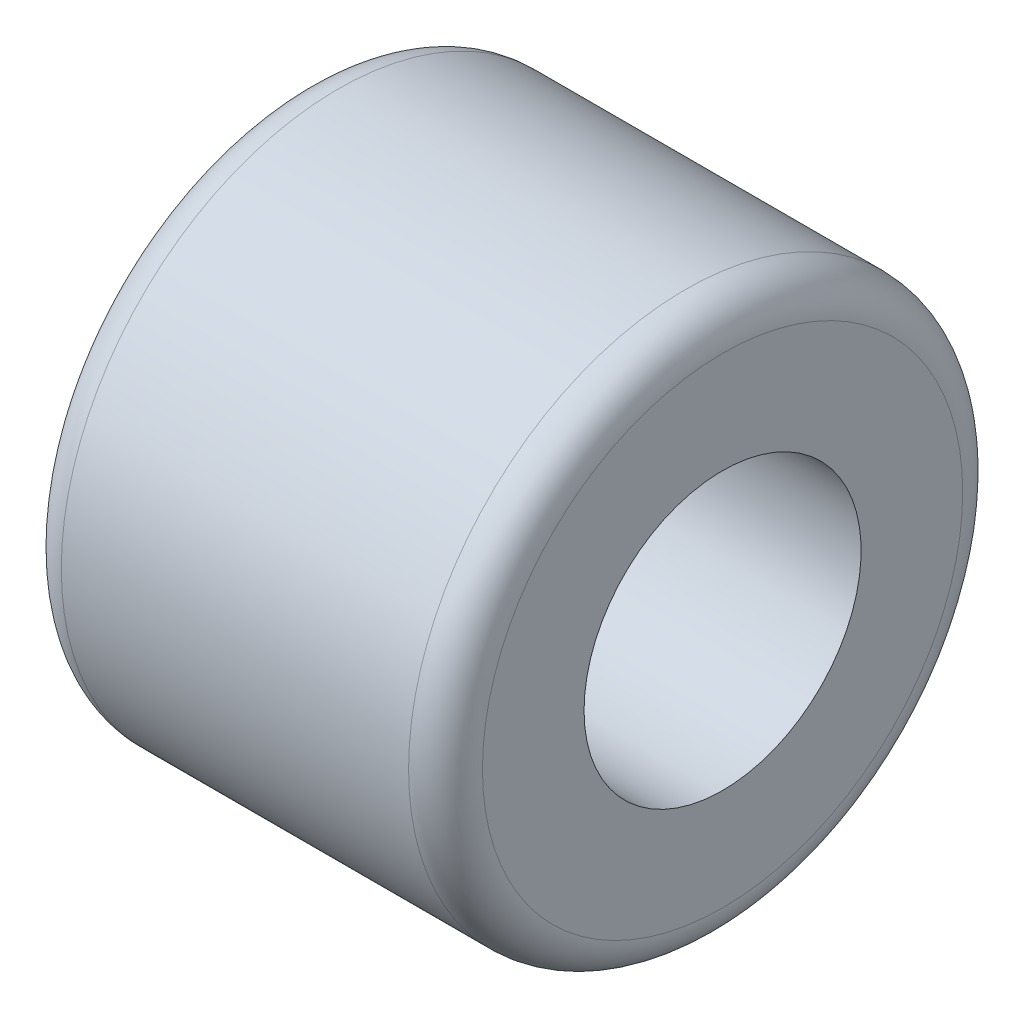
ISO-10303-21;
HEADER;
FILE_DESCRIPTION(('STEP AP214'),'2;1');
FILE_NAME('part.step','',(''),(''),'','','');
FILE_SCHEMA(('AUTOMOTIVE_DESIGN { 1 0 10303 214 1 1 1 1 }'));
ENDSEC;
DATA;
#1=APPLICATION_CONTEXT('core data for automotive mechanical design processes');
#2=APPLICATION_PROTOCOL_DEFINITION('international standard','automotive_design',2000,#1);
#3=PRODUCT_CONTEXT('',#1,'mechanical');
#4=PRODUCT('Part','Part','',(#3));
#5=PRODUCT_RELATED_PRODUCT_CATEGORY('part','',(#4));
#6=PRODUCT_DEFINITION_FORMATION('','',#4);
#7=PRODUCT_DEFINITION_CONTEXT('part definition',#1,'design');
#8=PRODUCT_DEFINITION('design','',#6,#7);
#9=PRODUCT_DEFINITION_SHAPE('','',#8);
#10=(LENGTH_UNIT() NAMED_UNIT(*) SI_UNIT(.MILLI.,.METRE.));
#11=(NAMED_UNIT(*) PLANE_ANGLE_UNIT() SI_UNIT($,.RADIAN.));
#12=(NAMED_UNIT(*) SI_UNIT($,.STERADIAN.) SOLID_ANGLE_UNIT());
#13=UNCERTAINTY_MEASURE_WITH_UNIT(LENGTH_MEASURE(1.E-05),#10,'distance_accuracy_value','');
#14=(GEOMETRIC_REPRESENTATION_CONTEXT(3) GLOBAL_UNCERTAINTY_ASSIGNED_CONTEXT((#13)) GLOBAL_UNIT_ASSIGNED_CONTEXT((#10,
#11,#12)) REPRESENTATION_CONTEXT('',''));
#15=CARTESIAN_POINT('',(0.,0.,0.));
#16=DIRECTION('',(0.,0.,1.));
#17=DIRECTION('',(1.,0.,0.));
#18=AXIS2_PLACEMENT_3D('',#15,#16,#17);
#19=CARTESIAN_POINT('',(-19.,21.6666666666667,0.));
#20=DIRECTION('',(1.,0.,0.));
#21=DIRECTION('',(0.,0.,-1.));
#22=AXIS2_PLACEMENT_3D('',#19,#20,#21);
#23=PLANE('',#22);
#24=CARTESIAN_POINT('',(-19.,0.,0.));
#25=DIRECTION('',(-1.,0.,0.));
#26=DIRECTION('',(0.,0.,1.));
#27=AXIS2_PLACEMENT_3D('',#24,#25,#26);
#28=CIRCLE('',#27,12.5);
#29=CARTESIAN_POINT('',(-19.,0.,12.5));
#30=VERTEX_POINT('',#29);
#31=EDGE_CURVE('E10',#30,#30,#28,.T.);
#32=ORIENTED_EDGE('',*,*,#31,.F.);
#33=EDGE_LOOP('',(#32));
#34=FACE_BOUND('',#33,.T.);
#35=CARTESIAN_POINT('',(-19.,0.,0.));
#36=DIRECTION('',(-1.,0.,0.));
#37=DIRECTION('',(0.,0.,1.));
#38=AXIS2_PLACEMENT_3D('',#35,#36,#37);
#39=CIRCLE('',#38,21.6666666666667);
#40=CARTESIAN_POINT('',(-19.,0.,21.6666666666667));
#41=VERTEX_POINT('',#40);
#42=EDGE_CURVE('E54',#41,#41,#39,.T.);
#43=ORIENTED_EDGE('',*,*,#42,.T.);
#44=EDGE_LOOP('',(#43));
#45=FACE_BOUND('',#44,.T.);
#46=ADVANCED_FACE('F32',(#34,#45),#23,.F.);
#47=CARTESIAN_POINT('',(50.,0.,0.));
#48=DIRECTION('',(-1.,0.,0.));
#49=DIRECTION('',(0.,0.,1.));
#50=AXIS2_PLACEMENT_3D('',#47,#48,#49);
#51=CYLINDRICAL_SURFACE('',#50,12.5);
#52=CARTESIAN_POINT('',(19.,0.,0.));
#53=DIRECTION('',(-1.,0.,0.));
#54=DIRECTION('',(0.,0.,1.));
#55=AXIS2_PLACEMENT_3D('',#52,#53,#54);
#56=CIRCLE('',#55,12.5);
#57=CARTESIAN_POINT('',(19.,0.,12.5));
#58=VERTEX_POINT('',#57);
#59=EDGE_CURVE('E38',#58,#58,#56,.T.);
#60=ORIENTED_EDGE('',*,*,#59,.F.);
#61=EDGE_LOOP('',(#60));
#62=FACE_BOUND('',#61,.T.);
#63=ORIENTED_EDGE('',*,*,#31,.T.);
#64=EDGE_LOOP('',(#63));
#65=FACE_BOUND('',#64,.T.);
#66=ADVANCED_FACE('F79',(#62,#65),#51,.F.);
#67=CARTESIAN_POINT('',(19.,12.5,0.));
#68=DIRECTION('',(-1.,0.,0.));
#69=DIRECTION('',(0.,0.,1.));
#70=AXIS2_PLACEMENT_3D('',#67,#68,#69);
#71=PLANE('',#70);
#72=CARTESIAN_POINT('',(19.,0.,0.));
#73=DIRECTION('',(-1.,0.,0.));
#74=DIRECTION('',(0.,0.,1.));
#75=AXIS2_PLACEMENT_3D('',#72,#73,#74);
#76=CIRCLE('',#75,21.6666666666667);
#77=CARTESIAN_POINT('',(19.,0.,21.6666666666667));
#78=VERTEX_POINT('',#77);
#79=EDGE_CURVE('E42',#78,#78,#76,.T.);
#80=ORIENTED_EDGE('',*,*,#79,.F.);
#81=EDGE_LOOP('',(#80));
#82=FACE_BOUND('',#81,.T.);
#83=ORIENTED_EDGE('',*,*,#59,.T.);
#84=EDGE_LOOP('',(#83));
#85=FACE_BOUND('',#84,.T.);
#86=ADVANCED_FACE('F74',(#82,#85),#71,.F.);
#87=CARTESIAN_POINT('',(15.6666666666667,0.,0.));
#88=DIRECTION('',(-1.,0.,0.));
#89=DIRECTION('',(0.,0.,1.));
#90=AXIS2_PLACEMENT_3D('',#87,#88,#89);
#91=TOROIDAL_SURFACE('',#90,21.6666666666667,3.33333333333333);
#92=CARTESIAN_POINT('',(15.6666666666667,0.,0.));
#93=DIRECTION('',(-1.,0.,0.));
#94=DIRECTION('',(0.,0.,1.));
#95=AXIS2_PLACEMENT_3D('',#92,#93,#94);
#96=CIRCLE('',#95,25.);
#97=CARTESIAN_POINT('',(15.6666666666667,0.,25.));
#98=VERTEX_POINT('',#97);
#99=EDGE_CURVE('E46',#98,#98,#96,.T.);
#100=ORIENTED_EDGE('',*,*,#99,.F.);
#101=EDGE_LOOP('',(#100));
#102=FACE_BOUND('',#101,.T.);
#103=ORIENTED_EDGE('',*,*,#79,.T.);
#104=EDGE_LOOP('',(#103));
#105=FACE_BOUND('',#104,.T.);
#106=ADVANCED_FACE('F68',(#102,#105),#91,.T.);
#107=CARTESIAN_POINT('',(50.,0.,0.));
#108=DIRECTION('',(-1.,0.,0.));
#109=DIRECTION('',(0.,0.,1.));
#110=AXIS2_PLACEMENT_3D('',#107,#108,#109);
#111=CYLINDRICAL_SURFACE('',#110,25.);
#112=CARTESIAN_POINT('',(-15.6666666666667,0.,0.));
#113=DIRECTION('',(-1.,0.,0.));
#114=DIRECTION('',(0.,0.,1.));
#115=AXIS2_PLACEMENT_3D('',#112,#113,#114);
#116=CIRCLE('',#115,25.);
#117=CARTESIAN_POINT('',(-15.6666666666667,0.,25.));
#118=VERTEX_POINT('',#117);
#119=EDGE_CURVE('E51',#118,#118,#116,.T.);
#120=ORIENTED_EDGE('',*,*,#119,.F.);
#121=EDGE_LOOP('',(#120));
#122=FACE_BOUND('',#121,.T.);
#123=ORIENTED_EDGE('',*,*,#99,.T.);
#124=EDGE_LOOP('',(#123));
#125=FACE_BOUND('',#124,.T.);
#126=ADVANCED_FACE('F62',(#122,#125),#111,.T.);
#127=CARTESIAN_POINT('',(-15.6666666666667,0.,0.));
#128=DIRECTION('',(-1.,0.,0.));
#129=DIRECTION('',(0.,0.,1.));
#130=AXIS2_PLACEMENT_3D('',#127,#128,#129);
#131=TOROIDAL_SURFACE('',#130,21.6666666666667,3.33333333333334);
#132=ORIENTED_EDGE('',*,*,#42,.F.);
#133=EDGE_LOOP('',(#132));
#134=FACE_BOUND('',#133,.T.);
#135=ORIENTED_EDGE('',*,*,#119,.T.);
#136=EDGE_LOOP('',(#135));
#137=FACE_BOUND('',#136,.T.);
#138=ADVANCED_FACE('F59',(#134,#137),#131,.T.);
#139=CLOSED_SHELL('',(#46,#66,#86,#106,#126,#138));
#140=MANIFOLD_SOLID_BREP('B2',#139);
#141=ADVANCED_BREP_SHAPE_REPRESENTATION('',(#18,#140),#14);
#142=SHAPE_DEFINITION_REPRESENTATION(#9,#141);
ENDSEC;
END-ISO-10303-21;
